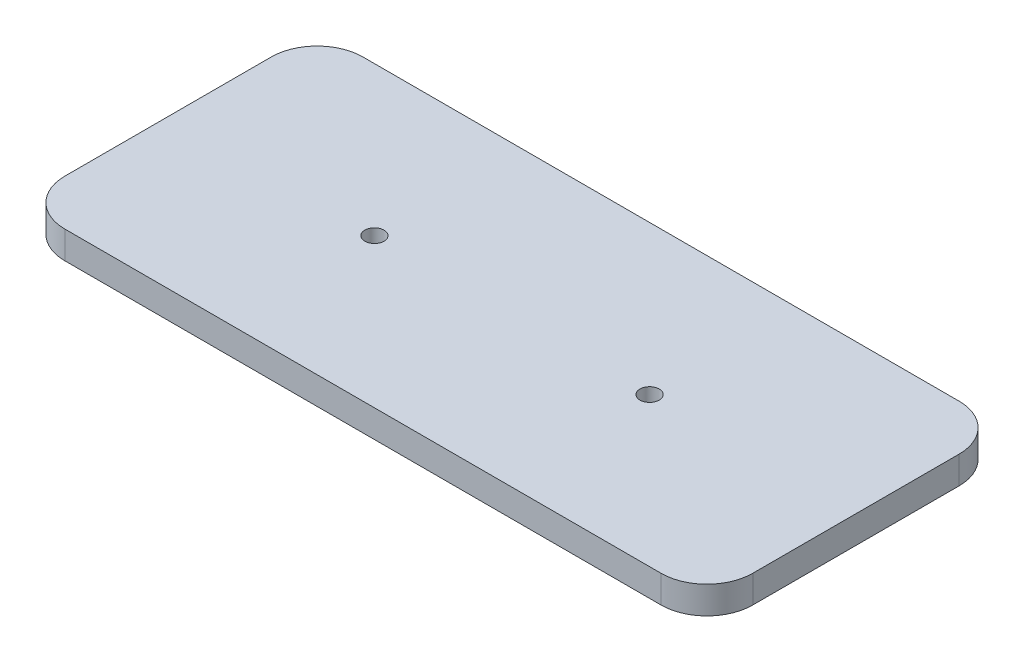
ISO-10303-21;
HEADER;
FILE_DESCRIPTION(('STEP AP214'),'2;1');
FILE_NAME('part.step','',(''),(''),'','','');
FILE_SCHEMA(('AUTOMOTIVE_DESIGN { 1 0 10303 214 1 1 1 1 }'));
ENDSEC;
DATA;
#1=APPLICATION_CONTEXT('core data for automotive mechanical design processes');
#2=APPLICATION_PROTOCOL_DEFINITION('international standard','automotive_design',2000,#1);
#3=PRODUCT_CONTEXT('',#1,'mechanical');
#4=PRODUCT('Part','Part','',(#3));
#5=PRODUCT_RELATED_PRODUCT_CATEGORY('part','',(#4));
#6=PRODUCT_DEFINITION_FORMATION('','',#4);
#7=PRODUCT_DEFINITION_CONTEXT('part definition',#1,'design');
#8=PRODUCT_DEFINITION('design','',#6,#7);
#9=PRODUCT_DEFINITION_SHAPE('','',#8);
#10=(LENGTH_UNIT() NAMED_UNIT(*) SI_UNIT(.MILLI.,.METRE.));
#11=(NAMED_UNIT(*) PLANE_ANGLE_UNIT() SI_UNIT($,.RADIAN.));
#12=(NAMED_UNIT(*) SI_UNIT($,.STERADIAN.) SOLID_ANGLE_UNIT());
#13=UNCERTAINTY_MEASURE_WITH_UNIT(LENGTH_MEASURE(1.E-05),#10,'distance_accuracy_value','');
#14=(GEOMETRIC_REPRESENTATION_CONTEXT(3) GLOBAL_UNCERTAINTY_ASSIGNED_CONTEXT((#13)) GLOBAL_UNIT_ASSIGNED_CONTEXT((#10,
#11,#12)) REPRESENTATION_CONTEXT('',''));
#15=CARTESIAN_POINT('',(0.,0.,0.));
#16=DIRECTION('',(0.,0.,1.));
#17=DIRECTION('',(1.,0.,0.));
#18=AXIS2_PLACEMENT_3D('',#15,#16,#17);
#19=CARTESIAN_POINT('',(140.,6.,-55.));
#20=DIRECTION('',(0.,-1.,0.));
#21=DIRECTION('',(0.,0.,-1.));
#22=AXIS2_PLACEMENT_3D('',#19,#20,#21);
#23=CYLINDRICAL_SURFACE('',#22,10.);
#24=CARTESIAN_POINT('',(140.,0.,-55.));
#25=DIRECTION('',(0.,1.,0.));
#26=DIRECTION('',(0.,0.,1.));
#27=AXIS2_PLACEMENT_3D('',#24,#25,#26);
#28=CIRCLE('',#27,10.);
#29=CARTESIAN_POINT('',(150.,0.,-54.9999999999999));
#30=VERTEX_POINT('',#29);
#31=CARTESIAN_POINT('',(140.,0.,-65.));
#32=VERTEX_POINT('',#31);
#33=EDGE_CURVE('E127',#30,#32,#28,.T.);
#34=ORIENTED_EDGE('',*,*,#33,.T.);
#35=DIRECTION('',(0.,-1.,0.));
#36=VECTOR('',#35,1.);
#37=CARTESIAN_POINT('',(140.,6.,-65.));
#38=LINE('',#37,#36);
#39=CARTESIAN_POINT('',(140.,6.,-65.));
#40=VERTEX_POINT('',#39);
#41=EDGE_CURVE('E11',#40,#32,#38,.T.);
#42=ORIENTED_EDGE('',*,*,#41,.F.);
#43=CARTESIAN_POINT('',(140.,6.,-55.));
#44=DIRECTION('',(0.,1.,0.));
#45=DIRECTION('',(0.,0.,1.));
#46=AXIS2_PLACEMENT_3D('',#43,#44,#45);
#47=CIRCLE('',#46,10.);
#48=CARTESIAN_POINT('',(150.,6.,-54.9999999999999));
#49=VERTEX_POINT('',#48);
#50=EDGE_CURVE('E142',#49,#40,#47,.T.);
#51=ORIENTED_EDGE('',*,*,#50,.F.);
#52=DIRECTION('',(0.,-1.,0.));
#53=VECTOR('',#52,1.);
#54=CARTESIAN_POINT('',(150.,6.,-54.9999999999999));
#55=LINE('',#54,#53);
#56=EDGE_CURVE('E123',#49,#30,#55,.T.);
#57=ORIENTED_EDGE('',*,*,#56,.T.);
#58=EDGE_LOOP('',(#34,#42,#51,#57));
#59=FACE_BOUND('',#58,.T.);
#60=ADVANCED_FACE('F31',(#59),#23,.T.);
#61=CARTESIAN_POINT('',(10.0000000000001,6.,-65.));
#62=DIRECTION('',(0.,0.,1.));
#63=DIRECTION('',(1.,0.,0.));
#64=AXIS2_PLACEMENT_3D('',#61,#62,#63);
#65=PLANE('',#64);
#66=DIRECTION('',(-1.,0.,0.));
#67=VECTOR('',#66,1.);
#68=CARTESIAN_POINT('',(10.0000000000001,0.,-65.));
#69=LINE('',#68,#67);
#70=CARTESIAN_POINT('',(10.0000000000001,0.,-65.));
#71=VERTEX_POINT('',#70);
#72=EDGE_CURVE('E130',#32,#71,#69,.T.);
#73=ORIENTED_EDGE('',*,*,#72,.T.);
#74=DIRECTION('',(0.,-1.,0.));
#75=VECTOR('',#74,1.);
#76=CARTESIAN_POINT('',(10.0000000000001,6.,-65.));
#77=LINE('',#76,#75);
#78=CARTESIAN_POINT('',(10.0000000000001,6.,-65.));
#79=VERTEX_POINT('',#78);
#80=EDGE_CURVE('E39',#79,#71,#77,.T.);
#81=ORIENTED_EDGE('',*,*,#80,.F.);
#82=DIRECTION('',(-1.,0.,0.));
#83=VECTOR('',#82,1.);
#84=CARTESIAN_POINT('',(10.0000000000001,6.,-65.));
#85=LINE('',#84,#83);
#86=EDGE_CURVE('E90',#40,#79,#85,.T.);
#87=ORIENTED_EDGE('',*,*,#86,.F.);
#88=ORIENTED_EDGE('',*,*,#41,.T.);
#89=EDGE_LOOP('',(#73,#81,#87,#88));
#90=FACE_BOUND('',#89,.T.);
#91=ADVANCED_FACE('F209',(#90),#65,.F.);
#92=CARTESIAN_POINT('',(10.,6.,-55.));
#93=DIRECTION('',(0.,-1.,0.));
#94=DIRECTION('',(0.,0.,-1.));
#95=AXIS2_PLACEMENT_3D('',#92,#93,#94);
#96=CYLINDRICAL_SURFACE('',#95,10.);
#97=CARTESIAN_POINT('',(10.,0.,-55.));
#98=DIRECTION('',(0.,1.,0.));
#99=DIRECTION('',(0.,0.,1.));
#100=AXIS2_PLACEMENT_3D('',#97,#98,#99);
#101=CIRCLE('',#100,10.);
#102=CARTESIAN_POINT('',(0.,0.,-54.9999999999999));
#103=VERTEX_POINT('',#102);
#104=EDGE_CURVE('E133',#71,#103,#101,.T.);
#105=ORIENTED_EDGE('',*,*,#104,.T.);
#106=DIRECTION('',(0.,-1.,0.));
#107=VECTOR('',#106,1.);
#108=CARTESIAN_POINT('',(0.,6.,-54.9999999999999));
#109=LINE('',#108,#107);
#110=CARTESIAN_POINT('',(0.,6.,-54.9999999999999));
#111=VERTEX_POINT('',#110);
#112=EDGE_CURVE('E149',#111,#103,#109,.T.);
#113=ORIENTED_EDGE('',*,*,#112,.F.);
#114=CARTESIAN_POINT('',(10.,6.,-55.));
#115=DIRECTION('',(0.,1.,0.));
#116=DIRECTION('',(0.,0.,1.));
#117=AXIS2_PLACEMENT_3D('',#114,#115,#116);
#118=CIRCLE('',#117,10.);
#119=EDGE_CURVE('E157',#79,#111,#118,.T.);
#120=ORIENTED_EDGE('',*,*,#119,.F.);
#121=ORIENTED_EDGE('',*,*,#80,.T.);
#122=EDGE_LOOP('',(#105,#113,#120,#121));
#123=FACE_BOUND('',#122,.T.);
#124=ADVANCED_FACE('F155',(#123),#96,.T.);
#125=CARTESIAN_POINT('',(0.,6.,-10.0000000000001));
#126=DIRECTION('',(1.,0.,0.));
#127=DIRECTION('',(0.,0.,-1.));
#128=AXIS2_PLACEMENT_3D('',#125,#126,#127);
#129=PLANE('',#128);
#130=DIRECTION('',(0.,0.,1.));
#131=VECTOR('',#130,1.);
#132=CARTESIAN_POINT('',(0.,0.,-10.0000000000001));
#133=LINE('',#132,#131);
#134=CARTESIAN_POINT('',(0.,0.,-10.0000000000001));
#135=VERTEX_POINT('',#134);
#136=EDGE_CURVE('E135',#103,#135,#133,.T.);
#137=ORIENTED_EDGE('',*,*,#136,.T.);
#138=DIRECTION('',(0.,-1.,0.));
#139=VECTOR('',#138,1.);
#140=CARTESIAN_POINT('',(0.,6.,-10.0000000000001));
#141=LINE('',#140,#139);
#142=CARTESIAN_POINT('',(0.,6.,-10.0000000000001));
#143=VERTEX_POINT('',#142);
#144=EDGE_CURVE('E146',#143,#135,#141,.T.);
#145=ORIENTED_EDGE('',*,*,#144,.F.);
#146=DIRECTION('',(0.,0.,1.));
#147=VECTOR('',#146,1.);
#148=CARTESIAN_POINT('',(0.,6.,-10.0000000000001));
#149=LINE('',#148,#147);
#150=EDGE_CURVE('E169',#111,#143,#149,.T.);
#151=ORIENTED_EDGE('',*,*,#150,.F.);
#152=ORIENTED_EDGE('',*,*,#112,.T.);
#153=EDGE_LOOP('',(#137,#145,#151,#152));
#154=FACE_BOUND('',#153,.T.);
#155=ADVANCED_FACE('F165',(#154),#129,.F.);
#156=CARTESIAN_POINT('',(10.,6.,-10.));
#157=DIRECTION('',(0.,-1.,0.));
#158=DIRECTION('',(0.,0.,-1.));
#159=AXIS2_PLACEMENT_3D('',#156,#157,#158);
#160=CYLINDRICAL_SURFACE('',#159,10.);
#161=CARTESIAN_POINT('',(10.,0.,-10.));
#162=DIRECTION('',(0.,1.,0.));
#163=DIRECTION('',(0.,0.,1.));
#164=AXIS2_PLACEMENT_3D('',#161,#162,#163);
#165=CIRCLE('',#164,10.);
#166=CARTESIAN_POINT('',(10.0000000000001,0.,0.));
#167=VERTEX_POINT('',#166);
#168=EDGE_CURVE('E137',#135,#167,#165,.T.);
#169=ORIENTED_EDGE('',*,*,#168,.T.);
#170=DIRECTION('',(0.,-1.,0.));
#171=VECTOR('',#170,1.);
#172=CARTESIAN_POINT('',(10.0000000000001,6.,0.));
#173=LINE('',#172,#171);
#174=CARTESIAN_POINT('',(10.0000000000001,6.,0.));
#175=VERTEX_POINT('',#174);
#176=EDGE_CURVE('E118',#175,#167,#173,.T.);
#177=ORIENTED_EDGE('',*,*,#176,.F.);
#178=CARTESIAN_POINT('',(10.,6.,-10.));
#179=DIRECTION('',(0.,1.,0.));
#180=DIRECTION('',(0.,0.,1.));
#181=AXIS2_PLACEMENT_3D('',#178,#179,#180);
#182=CIRCLE('',#181,10.);
#183=EDGE_CURVE('E109',#143,#175,#182,.T.);
#184=ORIENTED_EDGE('',*,*,#183,.F.);
#185=ORIENTED_EDGE('',*,*,#144,.T.);
#186=EDGE_LOOP('',(#169,#177,#184,#185));
#187=FACE_BOUND('',#186,.T.);
#188=ADVANCED_FACE('F168',(#187),#160,.T.);
#189=CARTESIAN_POINT('',(10.0000000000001,6.,0.));
#190=DIRECTION('',(0.,0.,-1.));
#191=DIRECTION('',(-1.,0.,0.));
#192=AXIS2_PLACEMENT_3D('',#189,#190,#191);
#193=PLANE('',#192);
#194=DIRECTION('',(1.,0.,0.));
#195=VECTOR('',#194,1.);
#196=CARTESIAN_POINT('',(10.0000000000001,0.,0.));
#197=LINE('',#196,#195);
#198=CARTESIAN_POINT('',(140.,0.,0.));
#199=VERTEX_POINT('',#198);
#200=EDGE_CURVE('E117',#167,#199,#197,.T.);
#201=ORIENTED_EDGE('',*,*,#200,.T.);
#202=DIRECTION('',(0.,-1.,0.));
#203=VECTOR('',#202,1.);
#204=CARTESIAN_POINT('',(140.,6.,0.));
#205=LINE('',#204,#203);
#206=CARTESIAN_POINT('',(140.,6.,0.));
#207=VERTEX_POINT('',#206);
#208=EDGE_CURVE('E114',#207,#199,#205,.T.);
#209=ORIENTED_EDGE('',*,*,#208,.F.);
#210=DIRECTION('',(1.,0.,0.));
#211=VECTOR('',#210,1.);
#212=CARTESIAN_POINT('',(10.0000000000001,6.,0.));
#213=LINE('',#212,#211);
#214=EDGE_CURVE('E103',#175,#207,#213,.T.);
#215=ORIENTED_EDGE('',*,*,#214,.F.);
#216=ORIENTED_EDGE('',*,*,#176,.T.);
#217=EDGE_LOOP('',(#201,#209,#215,#216));
#218=FACE_BOUND('',#217,.T.);
#219=ADVANCED_FACE('F115',(#218),#193,.F.);
#220=CARTESIAN_POINT('',(140.,6.,-10.));
#221=DIRECTION('',(0.,-1.,0.));
#222=DIRECTION('',(0.,0.,-1.));
#223=AXIS2_PLACEMENT_3D('',#220,#221,#222);
#224=CYLINDRICAL_SURFACE('',#223,10.);
#225=CARTESIAN_POINT('',(140.,0.,-10.));
#226=DIRECTION('',(0.,1.,0.));
#227=DIRECTION('',(0.,0.,1.));
#228=AXIS2_PLACEMENT_3D('',#225,#226,#227);
#229=CIRCLE('',#228,10.);
#230=CARTESIAN_POINT('',(150.,0.,-10.0000000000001));
#231=VERTEX_POINT('',#230);
#232=EDGE_CURVE('E76',#199,#231,#229,.T.);
#233=ORIENTED_EDGE('',*,*,#232,.T.);
#234=DIRECTION('',(0.,-1.,0.));
#235=VECTOR('',#234,1.);
#236=CARTESIAN_POINT('',(150.,6.,-10.0000000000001));
#237=LINE('',#236,#235);
#238=CARTESIAN_POINT('',(150.,6.,-10.0000000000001));
#239=VERTEX_POINT('',#238);
#240=EDGE_CURVE('E119',#239,#231,#237,.T.);
#241=ORIENTED_EDGE('',*,*,#240,.F.);
#242=CARTESIAN_POINT('',(140.,6.,-10.));
#243=DIRECTION('',(0.,1.,0.));
#244=DIRECTION('',(0.,0.,1.));
#245=AXIS2_PLACEMENT_3D('',#242,#243,#244);
#246=CIRCLE('',#245,10.);
#247=EDGE_CURVE('E107',#207,#239,#246,.T.);
#248=ORIENTED_EDGE('',*,*,#247,.F.);
#249=ORIENTED_EDGE('',*,*,#208,.T.);
#250=EDGE_LOOP('',(#233,#241,#248,#249));
#251=FACE_BOUND('',#250,.T.);
#252=ADVANCED_FACE('F121',(#251),#224,.T.);
#253=CARTESIAN_POINT('',(150.,6.,-10.0000000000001));
#254=DIRECTION('',(-1.,0.,0.));
#255=DIRECTION('',(0.,0.,1.));
#256=AXIS2_PLACEMENT_3D('',#253,#254,#255);
#257=PLANE('',#256);
#258=DIRECTION('',(0.,0.,-1.));
#259=VECTOR('',#258,1.);
#260=CARTESIAN_POINT('',(150.,0.,-10.0000000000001));
#261=LINE('',#260,#259);
#262=EDGE_CURVE('E82',#231,#30,#261,.T.);
#263=ORIENTED_EDGE('',*,*,#262,.T.);
#264=ORIENTED_EDGE('',*,*,#56,.F.);
#265=DIRECTION('',(0.,0.,-1.));
#266=VECTOR('',#265,1.);
#267=CARTESIAN_POINT('',(150.,6.,-10.0000000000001));
#268=LINE('',#267,#266);
#269=EDGE_CURVE('E47',#239,#49,#268,.T.);
#270=ORIENTED_EDGE('',*,*,#269,.F.);
#271=ORIENTED_EDGE('',*,*,#240,.T.);
#272=EDGE_LOOP('',(#263,#264,#270,#271));
#273=FACE_BOUND('',#272,.T.);
#274=ADVANCED_FACE('F191',(#273),#257,.F.);
#275=CARTESIAN_POINT('',(140.,6.,-55.));
#276=DIRECTION('',(0.,1.,0.));
#277=DIRECTION('',(0.,0.,1.));
#278=AXIS2_PLACEMENT_3D('',#275,#276,#277);
#279=PLANE('',#278);
#280=CARTESIAN_POINT('',(45.,6.,-32.5));
#281=DIRECTION('',(0.,1.,0.));
#282=DIRECTION('',(0.,0.,1.));
#283=AXIS2_PLACEMENT_3D('',#280,#281,#282);
#284=CIRCLE('',#283,2.09999999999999);
#285=CARTESIAN_POINT('',(45.,6.,-30.4));
#286=VERTEX_POINT('',#285);
#287=EDGE_CURVE('E183',#286,#286,#284,.T.);
#288=ORIENTED_EDGE('',*,*,#287,.F.);
#289=EDGE_LOOP('',(#288));
#290=FACE_BOUND('',#289,.T.);
#291=CARTESIAN_POINT('',(105.,6.,-32.5));
#292=DIRECTION('',(0.,1.,0.));
#293=DIRECTION('',(0.,0.,1.));
#294=AXIS2_PLACEMENT_3D('',#291,#292,#293);
#295=CIRCLE('',#294,2.09999999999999);
#296=CARTESIAN_POINT('',(105.,6.,-30.4));
#297=VERTEX_POINT('',#296);
#298=EDGE_CURVE('E177',#297,#297,#295,.T.);
#299=ORIENTED_EDGE('',*,*,#298,.F.);
#300=EDGE_LOOP('',(#299));
#301=FACE_BOUND('',#300,.T.);
#302=ORIENTED_EDGE('',*,*,#50,.T.);
#303=ORIENTED_EDGE('',*,*,#86,.T.);
#304=ORIENTED_EDGE('',*,*,#119,.T.);
#305=ORIENTED_EDGE('',*,*,#150,.T.);
#306=ORIENTED_EDGE('',*,*,#183,.T.);
#307=ORIENTED_EDGE('',*,*,#214,.T.);
#308=ORIENTED_EDGE('',*,*,#247,.T.);
#309=ORIENTED_EDGE('',*,*,#269,.T.);
#310=EDGE_LOOP('',(#302,#303,#304,#305,#306,#307,#308,#309));
#311=FACE_BOUND('',#310,.T.);
#312=ADVANCED_FACE('F105',(#290,#301,#311),#279,.T.);
#313=CARTESIAN_POINT('',(140.,0.,-55.));
#314=DIRECTION('',(0.,1.,0.));
#315=DIRECTION('',(0.,0.,1.));
#316=AXIS2_PLACEMENT_3D('',#313,#314,#315);
#317=PLANE('',#316);
#318=CARTESIAN_POINT('',(45.,0.,-32.5));
#319=DIRECTION('',(0.,1.,0.));
#320=DIRECTION('',(0.,0.,1.));
#321=AXIS2_PLACEMENT_3D('',#318,#319,#320);
#322=CIRCLE('',#321,2.1);
#323=CARTESIAN_POINT('',(45.,0.,-30.4));
#324=VERTEX_POINT('',#323);
#325=EDGE_CURVE('E180',#324,#324,#322,.T.);
#326=ORIENTED_EDGE('',*,*,#325,.T.);
#327=EDGE_LOOP('',(#326));
#328=FACE_BOUND('',#327,.T.);
#329=CARTESIAN_POINT('',(105.,0.,-32.5));
#330=DIRECTION('',(0.,1.,0.));
#331=DIRECTION('',(0.,0.,1.));
#332=AXIS2_PLACEMENT_3D('',#329,#330,#331);
#333=CIRCLE('',#332,2.1);
#334=CARTESIAN_POINT('',(105.,0.,-30.4));
#335=VERTEX_POINT('',#334);
#336=EDGE_CURVE('E131',#335,#335,#333,.T.);
#337=ORIENTED_EDGE('',*,*,#336,.T.);
#338=EDGE_LOOP('',(#337));
#339=FACE_BOUND('',#338,.T.);
#340=ORIENTED_EDGE('',*,*,#33,.F.);
#341=ORIENTED_EDGE('',*,*,#262,.F.);
#342=ORIENTED_EDGE('',*,*,#232,.F.);
#343=ORIENTED_EDGE('',*,*,#200,.F.);
#344=ORIENTED_EDGE('',*,*,#168,.F.);
#345=ORIENTED_EDGE('',*,*,#136,.F.);
#346=ORIENTED_EDGE('',*,*,#104,.F.);
#347=ORIENTED_EDGE('',*,*,#72,.F.);
#348=EDGE_LOOP('',(#340,#341,#342,#343,#344,#345,#346,#347));
#349=FACE_BOUND('',#348,.T.);
#350=ADVANCED_FACE('F161',(#328,#339,#349),#317,.F.);
#351=CARTESIAN_POINT('',(105.,6.,-32.5));
#352=DIRECTION('',(0.,1.,0.));
#353=DIRECTION('',(0.,0.,1.));
#354=AXIS2_PLACEMENT_3D('',#351,#352,#353);
#355=CYLINDRICAL_SURFACE('',#354,2.1);
#356=ORIENTED_EDGE('',*,*,#336,.F.);
#357=EDGE_LOOP('',(#356));
#358=FACE_BOUND('',#357,.T.);
#359=ORIENTED_EDGE('',*,*,#298,.T.);
#360=EDGE_LOOP('',(#359));
#361=FACE_BOUND('',#360,.T.);
#362=ADVANCED_FACE('F195',(#358,#361),#355,.F.);
#363=CARTESIAN_POINT('',(45.,6.,-32.5));
#364=DIRECTION('',(0.,1.,0.));
#365=DIRECTION('',(0.,0.,1.));
#366=AXIS2_PLACEMENT_3D('',#363,#364,#365);
#367=CYLINDRICAL_SURFACE('',#366,2.09999999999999);
#368=ORIENTED_EDGE('',*,*,#325,.F.);
#369=EDGE_LOOP('',(#368));
#370=FACE_BOUND('',#369,.T.);
#371=ORIENTED_EDGE('',*,*,#287,.T.);
#372=EDGE_LOOP('',(#371));
#373=FACE_BOUND('',#372,.T.);
#374=ADVANCED_FACE('F187',(#370,#373),#367,.F.);
#375=CLOSED_SHELL('',(#60,#91,#124,#155,#188,#219,#252,#274,#312,#350,#362,#374));
#376=MANIFOLD_SOLID_BREP('B2',#375);
#377=ADVANCED_BREP_SHAPE_REPRESENTATION('',(#18,#376),#14);
#378=SHAPE_DEFINITION_REPRESENTATION(#9,#377);
ENDSEC;
END-ISO-10303-21;
